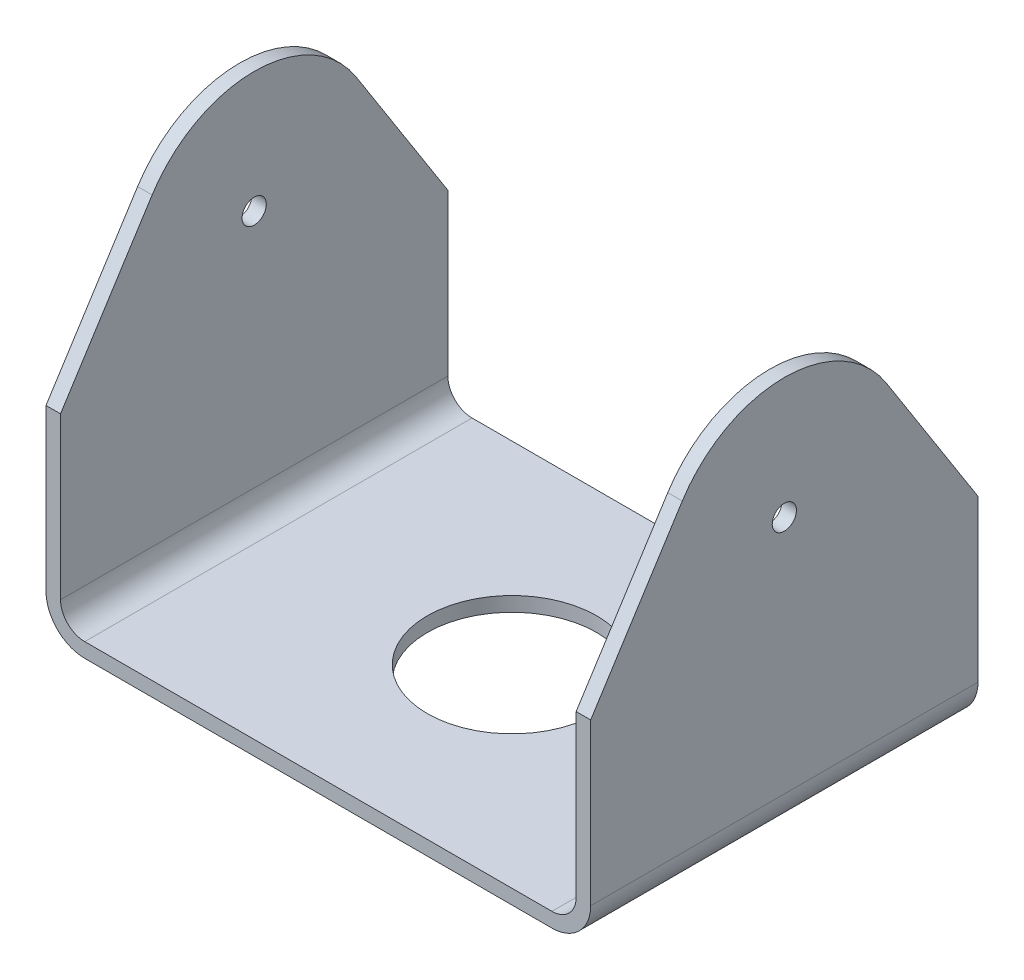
ISO-10303-21;
HEADER;
FILE_DESCRIPTION(('STEP AP214'),'2;1');
FILE_NAME('part.step','',(''),(''),'','','');
FILE_SCHEMA(('AUTOMOTIVE_DESIGN { 1 0 10303 214 1 1 1 1 }'));
ENDSEC;
DATA;
#1=APPLICATION_CONTEXT('core data for automotive mechanical design processes');
#2=APPLICATION_PROTOCOL_DEFINITION('international standard','automotive_design',2000,#1);
#3=PRODUCT_CONTEXT('',#1,'mechanical');
#4=PRODUCT('Part','Part','',(#3));
#5=PRODUCT_RELATED_PRODUCT_CATEGORY('part','',(#4));
#6=PRODUCT_DEFINITION_FORMATION('','',#4);
#7=PRODUCT_DEFINITION_CONTEXT('part definition',#1,'design');
#8=PRODUCT_DEFINITION('design','',#6,#7);
#9=PRODUCT_DEFINITION_SHAPE('','',#8);
#10=(LENGTH_UNIT() NAMED_UNIT(*) SI_UNIT(.MILLI.,.METRE.));
#11=(NAMED_UNIT(*) PLANE_ANGLE_UNIT() SI_UNIT($,.RADIAN.));
#12=(NAMED_UNIT(*) SI_UNIT($,.STERADIAN.) SOLID_ANGLE_UNIT());
#13=UNCERTAINTY_MEASURE_WITH_UNIT(LENGTH_MEASURE(1.E-05),#10,'distance_accuracy_value','');
#14=(GEOMETRIC_REPRESENTATION_CONTEXT(3) GLOBAL_UNCERTAINTY_ASSIGNED_CONTEXT((#13)) GLOBAL_UNIT_ASSIGNED_CONTEXT((#10,
#11,#12)) REPRESENTATION_CONTEXT('',''));
#15=CARTESIAN_POINT('',(0.,0.,0.));
#16=DIRECTION('',(0.,0.,1.));
#17=DIRECTION('',(1.,0.,0.));
#18=AXIS2_PLACEMENT_3D('',#15,#16,#17);
#19=CARTESIAN_POINT('',(56.25,8.,40.));
#20=DIRECTION('',(-1.,0.,0.));
#21=DIRECTION('',(0.,-1.,0.));
#22=AXIS2_PLACEMENT_3D('',#19,#20,#21);
#23=PLANE('',#22);
#24=CARTESIAN_POINT('',(56.25,57.5,0.));
#25=DIRECTION('',(1.,0.,0.));
#26=DIRECTION('',(0.,1.,0.));
#27=AXIS2_PLACEMENT_3D('',#24,#25,#26);
#28=CIRCLE('',#27,2.5);
#29=CARTESIAN_POINT('',(56.25,60.,0.));
#30=VERTEX_POINT('',#29);
#31=EDGE_CURVE('E329',#30,#30,#28,.T.);
#32=ORIENTED_EDGE('',*,*,#31,.F.);
#33=EDGE_LOOP('',(#32));
#34=FACE_BOUND('',#33,.T.);
#35=DIRECTION('',(0.,0.843391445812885,-0.537299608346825));
#36=VECTOR('',#35,1.);
#37=CARTESIAN_POINT('',(56.25,70.9324902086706,21.0847861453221));
#38=LINE('',#37,#36);
#39=CARTESIAN_POINT('',(56.25,41.2415518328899,40.));
#40=VERTEX_POINT('',#39);
#41=CARTESIAN_POINT('',(56.25,70.9324902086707,21.0847861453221));
#42=VERTEX_POINT('',#41);
#43=EDGE_CURVE('E176',#40,#42,#38,.T.);
#44=ORIENTED_EDGE('',*,*,#43,.F.);
#45=DIRECTION('',(0.,1.,0.));
#46=VECTOR('',#45,1.);
#47=CARTESIAN_POINT('',(56.25,8.,40.));
#48=LINE('',#47,#46);
#49=CARTESIAN_POINT('',(56.25,8.,40.));
#50=VERTEX_POINT('',#49);
#51=EDGE_CURVE('E219',#50,#40,#48,.T.);
#52=ORIENTED_EDGE('',*,*,#51,.F.);
#53=DIRECTION('',(0.,0.,-1.));
#54=VECTOR('',#53,1.);
#55=CARTESIAN_POINT('',(56.25,8.,40.));
#56=LINE('',#55,#54);
#57=CARTESIAN_POINT('',(56.25,8.,-40.));
#58=VERTEX_POINT('',#57);
#59=EDGE_CURVE('E243',#50,#58,#56,.T.);
#60=ORIENTED_EDGE('',*,*,#59,.T.);
#61=DIRECTION('',(0.,1.,0.));
#62=VECTOR('',#61,1.);
#63=CARTESIAN_POINT('',(56.25,8.,-40.));
#64=LINE('',#63,#62);
#65=CARTESIAN_POINT('',(56.25,41.2415518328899,-40.));
#66=VERTEX_POINT('',#65);
#67=EDGE_CURVE('E151',#58,#66,#64,.T.);
#68=ORIENTED_EDGE('',*,*,#67,.T.);
#69=DIRECTION('',(0.,-0.843391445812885,-0.537299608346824));
#70=VECTOR('',#69,1.);
#71=CARTESIAN_POINT('',(56.25,70.9324902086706,-21.0847861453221));
#72=LINE('',#71,#70);
#73=CARTESIAN_POINT('',(56.25,70.9324902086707,-21.0847861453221));
#74=VERTEX_POINT('',#73);
#75=EDGE_CURVE('E166',#74,#66,#72,.T.);
#76=ORIENTED_EDGE('',*,*,#75,.F.);
#77=CARTESIAN_POINT('',(56.25,57.5,0.));
#78=DIRECTION('',(-1.,0.,0.));
#79=DIRECTION('',(0.,1.,0.));
#80=AXIS2_PLACEMENT_3D('',#77,#78,#79);
#81=CIRCLE('',#80,25.);
#82=EDGE_CURVE('E45',#42,#74,#81,.T.);
#83=ORIENTED_EDGE('',*,*,#82,.F.);
#84=EDGE_LOOP('',(#44,#52,#60,#68,#76,#83));
#85=FACE_BOUND('',#84,.T.);
#86=ADVANCED_FACE('F31',(#34,#85),#23,.F.);
#87=CARTESIAN_POINT('',(53.25,8.,40.));
#88=DIRECTION('',(-1.,0.,0.));
#89=DIRECTION('',(0.,-1.,0.));
#90=AXIS2_PLACEMENT_3D('',#87,#88,#89);
#91=PLANE('',#90);
#92=CARTESIAN_POINT('',(53.25,57.5,0.));
#93=DIRECTION('',(-1.,0.,0.));
#94=DIRECTION('',(0.,-1.,0.));
#95=AXIS2_PLACEMENT_3D('',#92,#93,#94);
#96=CIRCLE('',#95,2.5);
#97=CARTESIAN_POINT('',(53.25,55.,0.));
#98=VERTEX_POINT('',#97);
#99=EDGE_CURVE('E410',#98,#98,#96,.T.);
#100=ORIENTED_EDGE('',*,*,#99,.F.);
#101=EDGE_LOOP('',(#100));
#102=FACE_BOUND('',#101,.T.);
#103=DIRECTION('',(0.,1.,0.));
#104=VECTOR('',#103,1.);
#105=CARTESIAN_POINT('',(53.25,8.,40.));
#106=LINE('',#105,#104);
#107=CARTESIAN_POINT('',(53.25,8.,40.));
#108=VERTEX_POINT('',#107);
#109=CARTESIAN_POINT('',(53.25,41.2415518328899,40.));
#110=VERTEX_POINT('',#109);
#111=EDGE_CURVE('E222',#108,#110,#106,.T.);
#112=ORIENTED_EDGE('',*,*,#111,.T.);
#113=DIRECTION('',(0.,0.843391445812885,-0.537299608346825));
#114=VECTOR('',#113,1.);
#115=CARTESIAN_POINT('',(53.25,17.5965324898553,55.0635386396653));
#116=LINE('',#115,#114);
#117=CARTESIAN_POINT('',(53.25,70.9324902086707,21.0847861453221));
#118=VERTEX_POINT('',#117);
#119=EDGE_CURVE('E191',#110,#118,#116,.T.);
#120=ORIENTED_EDGE('',*,*,#119,.T.);
#121=CARTESIAN_POINT('',(53.25,57.5,0.));
#122=DIRECTION('',(-1.,0.,0.));
#123=DIRECTION('',(0.,-1.,0.));
#124=AXIS2_PLACEMENT_3D('',#121,#122,#123);
#125=CIRCLE('',#124,25.);
#126=CARTESIAN_POINT('',(53.25,70.9324902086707,-21.0847861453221));
#127=VERTEX_POINT('',#126);
#128=EDGE_CURVE('E158',#118,#127,#125,.T.);
#129=ORIENTED_EDGE('',*,*,#128,.T.);
#130=DIRECTION('',(0.,-0.843391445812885,-0.537299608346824));
#131=VECTOR('',#130,1.);
#132=CARTESIAN_POINT('',(53.25,53.8488439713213,-31.9682691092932));
#133=LINE('',#132,#131);
#134=CARTESIAN_POINT('',(53.25,41.2415518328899,-40.));
#135=VERTEX_POINT('',#134);
#136=EDGE_CURVE('E154',#127,#135,#133,.T.);
#137=ORIENTED_EDGE('',*,*,#136,.T.);
#138=DIRECTION('',(0.,1.,0.));
#139=VECTOR('',#138,1.);
#140=CARTESIAN_POINT('',(53.25,8.,-40.));
#141=LINE('',#140,#139);
#142=CARTESIAN_POINT('',(53.25,8.,-40.));
#143=VERTEX_POINT('',#142);
#144=EDGE_CURVE('E140',#143,#135,#141,.T.);
#145=ORIENTED_EDGE('',*,*,#144,.F.);
#146=DIRECTION('',(0.,0.,-1.));
#147=VECTOR('',#146,1.);
#148=CARTESIAN_POINT('',(53.25,8.,40.));
#149=LINE('',#148,#147);
#150=EDGE_CURVE('E262',#108,#143,#149,.T.);
#151=ORIENTED_EDGE('',*,*,#150,.F.);
#152=EDGE_LOOP('',(#112,#120,#129,#137,#145,#151));
#153=FACE_BOUND('',#152,.T.);
#154=ADVANCED_FACE('F156',(#102,#153),#91,.T.);
#155=CARTESIAN_POINT('',(-53.25,82.5,40.));
#156=DIRECTION('',(1.,0.,0.));
#157=DIRECTION('',(0.,1.,0.));
#158=AXIS2_PLACEMENT_3D('',#155,#156,#157);
#159=PLANE('',#158);
#160=CARTESIAN_POINT('',(-53.25,57.5,0.));
#161=DIRECTION('',(1.,0.,0.));
#162=DIRECTION('',(0.,1.,0.));
#163=AXIS2_PLACEMENT_3D('',#160,#161,#162);
#164=CIRCLE('',#163,2.5);
#165=CARTESIAN_POINT('',(-53.25,60.,0.));
#166=VERTEX_POINT('',#165);
#167=EDGE_CURVE('E405',#166,#166,#164,.T.);
#168=ORIENTED_EDGE('',*,*,#167,.F.);
#169=EDGE_LOOP('',(#168));
#170=FACE_BOUND('',#169,.T.);
#171=CARTESIAN_POINT('',(-53.25,57.5,0.));
#172=DIRECTION('',(1.,0.,0.));
#173=DIRECTION('',(0.,1.,0.));
#174=AXIS2_PLACEMENT_3D('',#171,#172,#173);
#175=CIRCLE('',#174,25.);
#176=CARTESIAN_POINT('',(-53.25,70.9324902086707,-21.0847861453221));
#177=VERTEX_POINT('',#176);
#178=CARTESIAN_POINT('',(-53.25,70.9324902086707,21.0847861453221));
#179=VERTEX_POINT('',#178);
#180=EDGE_CURVE('E193',#177,#179,#175,.T.);
#181=ORIENTED_EDGE('',*,*,#180,.T.);
#182=DIRECTION('',(0.,-0.843391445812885,0.537299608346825));
#183=VECTOR('',#182,1.);
#184=CARTESIAN_POINT('',(-53.25,70.5890627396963,21.30357357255));
#185=LINE('',#184,#183);
#186=CARTESIAN_POINT('',(-53.25,41.2415518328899,40.));
#187=VERTEX_POINT('',#186);
#188=EDGE_CURVE('E189',#179,#187,#185,.T.);
#189=ORIENTED_EDGE('',*,*,#188,.T.);
#190=DIRECTION('',(0.,-1.,0.));
#191=VECTOR('',#190,1.);
#192=CARTESIAN_POINT('',(-53.25,82.5,40.));
#193=LINE('',#192,#191);
#194=CARTESIAN_POINT('',(-53.25,8.,40.));
#195=VERTEX_POINT('',#194);
#196=EDGE_CURVE('E233',#187,#195,#193,.T.);
#197=ORIENTED_EDGE('',*,*,#196,.T.);
#198=DIRECTION('',(0.,0.,-1.));
#199=VECTOR('',#198,1.);
#200=CARTESIAN_POINT('',(-53.25,8.,40.));
#201=LINE('',#200,#199);
#202=CARTESIAN_POINT('',(-53.25,8.,-40.));
#203=VERTEX_POINT('',#202);
#204=EDGE_CURVE('E255',#195,#203,#201,.T.);
#205=ORIENTED_EDGE('',*,*,#204,.T.);
#206=DIRECTION('',(0.,-1.,0.));
#207=VECTOR('',#206,1.);
#208=CARTESIAN_POINT('',(-53.25,82.5,-40.));
#209=LINE('',#208,#207);
#210=CARTESIAN_POINT('',(-53.25,41.2415518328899,-40.));
#211=VERTEX_POINT('',#210);
#212=EDGE_CURVE('E209',#211,#203,#209,.T.);
#213=ORIENTED_EDGE('',*,*,#212,.F.);
#214=DIRECTION('',(0.,0.843391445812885,0.537299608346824));
#215=VECTOR('',#214,1.);
#216=CARTESIAN_POINT('',(-53.25,106.841374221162,1.79169595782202));
#217=LINE('',#216,#215);
#218=EDGE_CURVE('E162',#211,#177,#217,.T.);
#219=ORIENTED_EDGE('',*,*,#218,.T.);
#220=EDGE_LOOP('',(#181,#189,#197,#205,#213,#219));
#221=FACE_BOUND('',#220,.T.);
#222=ADVANCED_FACE('F293',(#170,#221),#159,.T.);
#223=CARTESIAN_POINT('',(-56.25,82.5,40.));
#224=DIRECTION('',(1.,0.,0.));
#225=DIRECTION('',(0.,1.,0.));
#226=AXIS2_PLACEMENT_3D('',#223,#224,#225);
#227=PLANE('',#226);
#228=CARTESIAN_POINT('',(-56.25,57.5,0.));
#229=DIRECTION('',(1.,0.,0.));
#230=DIRECTION('',(0.,1.,0.));
#231=AXIS2_PLACEMENT_3D('',#228,#229,#230);
#232=CIRCLE('',#231,2.5);
#233=CARTESIAN_POINT('',(-56.25,60.,0.));
#234=VERTEX_POINT('',#233);
#235=EDGE_CURVE('E408',#234,#234,#232,.T.);
#236=ORIENTED_EDGE('',*,*,#235,.T.);
#237=EDGE_LOOP('',(#236));
#238=FACE_BOUND('',#237,.T.);
#239=DIRECTION('',(0.,-0.843391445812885,0.537299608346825));
#240=VECTOR('',#239,1.);
#241=CARTESIAN_POINT('',(-56.25,70.5890627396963,21.30357357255));
#242=LINE('',#241,#240);
#243=CARTESIAN_POINT('',(-56.25,70.9324902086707,21.0847861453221));
#244=VERTEX_POINT('',#243);
#245=CARTESIAN_POINT('',(-56.25,41.2415518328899,40.));
#246=VERTEX_POINT('',#245);
#247=EDGE_CURVE('E161',#244,#246,#242,.T.);
#248=ORIENTED_EDGE('',*,*,#247,.F.);
#249=CARTESIAN_POINT('',(-56.25,57.5,0.));
#250=DIRECTION('',(1.,0.,0.));
#251=DIRECTION('',(0.,1.,0.));
#252=AXIS2_PLACEMENT_3D('',#249,#250,#251);
#253=CIRCLE('',#252,25.);
#254=CARTESIAN_POINT('',(-56.25,70.9324902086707,-21.0847861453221));
#255=VERTEX_POINT('',#254);
#256=EDGE_CURVE('E11',#255,#244,#253,.T.);
#257=ORIENTED_EDGE('',*,*,#256,.F.);
#258=DIRECTION('',(0.,0.843391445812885,0.537299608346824));
#259=VECTOR('',#258,1.);
#260=CARTESIAN_POINT('',(-56.25,106.841374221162,1.79169595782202));
#261=LINE('',#260,#259);
#262=CARTESIAN_POINT('',(-56.25,41.2415518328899,-40.));
#263=VERTEX_POINT('',#262);
#264=EDGE_CURVE('E183',#263,#255,#261,.T.);
#265=ORIENTED_EDGE('',*,*,#264,.F.);
#266=DIRECTION('',(0.,-1.,0.));
#267=VECTOR('',#266,1.);
#268=CARTESIAN_POINT('',(-56.25,82.5,-40.));
#269=LINE('',#268,#267);
#270=CARTESIAN_POINT('',(-56.25,8.,-40.));
#271=VERTEX_POINT('',#270);
#272=EDGE_CURVE('E211',#263,#271,#269,.T.);
#273=ORIENTED_EDGE('',*,*,#272,.T.);
#274=DIRECTION('',(0.,0.,-1.));
#275=VECTOR('',#274,1.);
#276=CARTESIAN_POINT('',(-56.25,8.,40.));
#277=LINE('',#276,#275);
#278=CARTESIAN_POINT('',(-56.25,8.,40.));
#279=VERTEX_POINT('',#278);
#280=EDGE_CURVE('E252',#279,#271,#277,.T.);
#281=ORIENTED_EDGE('',*,*,#280,.F.);
#282=DIRECTION('',(0.,-1.,0.));
#283=VECTOR('',#282,1.);
#284=CARTESIAN_POINT('',(-56.25,82.5,40.));
#285=LINE('',#284,#283);
#286=EDGE_CURVE('E235',#246,#279,#285,.T.);
#287=ORIENTED_EDGE('',*,*,#286,.F.);
#288=EDGE_LOOP('',(#248,#257,#265,#273,#281,#287));
#289=FACE_BOUND('',#288,.T.);
#290=ADVANCED_FACE('F277',(#238,#289),#227,.F.);
#291=CARTESIAN_POINT('',(48.25,8.,40.));
#292=DIRECTION('',(0.,0.,1.));
#293=DIRECTION('',(1.,0.,0.));
#294=AXIS2_PLACEMENT_3D('',#291,#292,#293);
#295=PLANE('',#294);
#296=ORIENTED_EDGE('',*,*,#51,.T.);
#297=DIRECTION('',(-1.,0.,0.));
#298=VECTOR('',#297,1.);
#299=CARTESIAN_POINT('',(56.25,41.2415518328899,40.));
#300=LINE('',#299,#298);
#301=EDGE_CURVE('E180',#40,#110,#300,.T.);
#302=ORIENTED_EDGE('',*,*,#301,.T.);
#303=ORIENTED_EDGE('',*,*,#111,.F.);
#304=CARTESIAN_POINT('',(48.25,8.,40.));
#305=DIRECTION('',(0.,0.,1.));
#306=DIRECTION('',(1.,0.,0.));
#307=AXIS2_PLACEMENT_3D('',#304,#305,#306);
#308=CIRCLE('',#307,5.);
#309=CARTESIAN_POINT('',(48.25,3.,40.));
#310=VERTEX_POINT('',#309);
#311=EDGE_CURVE('E224',#310,#108,#308,.T.);
#312=ORIENTED_EDGE('',*,*,#311,.F.);
#313=DIRECTION('',(1.,0.,0.));
#314=VECTOR('',#313,1.);
#315=CARTESIAN_POINT('',(-48.25,3.,40.));
#316=LINE('',#315,#314);
#317=CARTESIAN_POINT('',(-48.25,3.,40.));
#318=VERTEX_POINT('',#317);
#319=EDGE_CURVE('E227',#318,#310,#316,.T.);
#320=ORIENTED_EDGE('',*,*,#319,.F.);
#321=CARTESIAN_POINT('',(-48.25,8.,40.));
#322=DIRECTION('',(0.,0.,1.));
#323=DIRECTION('',(1.,0.,0.));
#324=AXIS2_PLACEMENT_3D('',#321,#322,#323);
#325=CIRCLE('',#324,5.00000000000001);
#326=EDGE_CURVE('E230',#195,#318,#325,.T.);
#327=ORIENTED_EDGE('',*,*,#326,.F.);
#328=ORIENTED_EDGE('',*,*,#196,.F.);
#329=DIRECTION('',(-1.,0.,0.));
#330=VECTOR('',#329,1.);
#331=CARTESIAN_POINT('',(48.25,41.2415518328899,40.));
#332=LINE('',#331,#330);
#333=EDGE_CURVE('E38',#187,#246,#332,.T.);
#334=ORIENTED_EDGE('',*,*,#333,.T.);
#335=ORIENTED_EDGE('',*,*,#286,.T.);
#336=CARTESIAN_POINT('',(-48.25,8.,40.));
#337=DIRECTION('',(0.,0.,1.));
#338=DIRECTION('',(1.,0.,0.));
#339=AXIS2_PLACEMENT_3D('',#336,#337,#338);
#340=CIRCLE('',#339,8.00000000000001);
#341=CARTESIAN_POINT('',(-48.25,0.,40.));
#342=VERTEX_POINT('',#341);
#343=EDGE_CURVE('E237',#279,#342,#340,.T.);
#344=ORIENTED_EDGE('',*,*,#343,.T.);
#345=DIRECTION('',(1.,0.,0.));
#346=VECTOR('',#345,1.);
#347=CARTESIAN_POINT('',(-48.25,0.,40.));
#348=LINE('',#347,#346);
#349=CARTESIAN_POINT('',(48.25,0.,40.));
#350=VERTEX_POINT('',#349);
#351=EDGE_CURVE('E239',#342,#350,#348,.T.);
#352=ORIENTED_EDGE('',*,*,#351,.T.);
#353=CARTESIAN_POINT('',(48.25,8.,40.));
#354=DIRECTION('',(0.,0.,1.));
#355=DIRECTION('',(1.,0.,0.));
#356=AXIS2_PLACEMENT_3D('',#353,#354,#355);
#357=CIRCLE('',#356,8.);
#358=EDGE_CURVE('E241',#350,#50,#357,.T.);
#359=ORIENTED_EDGE('',*,*,#358,.T.);
#360=EDGE_LOOP('',(#296,#302,#303,#312,#320,#327,#328,#334,#335,#344,#352,#359));
#361=FACE_BOUND('',#360,.T.);
#362=ADVANCED_FACE('F270',(#361),#295,.T.);
#363=CARTESIAN_POINT('',(48.25,8.,-40.));
#364=DIRECTION('',(0.,0.,1.));
#365=DIRECTION('',(1.,0.,0.));
#366=AXIS2_PLACEMENT_3D('',#363,#364,#365);
#367=PLANE('',#366);
#368=DIRECTION('',(-1.,0.,0.));
#369=VECTOR('',#368,1.);
#370=CARTESIAN_POINT('',(56.25,41.2415518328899,-40.));
#371=LINE('',#370,#369);
#372=EDGE_CURVE('E145',#66,#135,#371,.T.);
#373=ORIENTED_EDGE('',*,*,#372,.F.);
#374=ORIENTED_EDGE('',*,*,#67,.F.);
#375=CARTESIAN_POINT('',(48.25,8.,-40.));
#376=DIRECTION('',(0.,0.,1.));
#377=DIRECTION('',(1.,0.,0.));
#378=AXIS2_PLACEMENT_3D('',#375,#376,#377);
#379=CIRCLE('',#378,8.);
#380=CARTESIAN_POINT('',(48.25,0.,-40.));
#381=VERTEX_POINT('',#380);
#382=EDGE_CURVE('E217',#381,#58,#379,.T.);
#383=ORIENTED_EDGE('',*,*,#382,.F.);
#384=DIRECTION('',(1.,0.,0.));
#385=VECTOR('',#384,1.);
#386=CARTESIAN_POINT('',(-48.25,0.,-40.));
#387=LINE('',#386,#385);
#388=CARTESIAN_POINT('',(-48.25,0.,-40.));
#389=VERTEX_POINT('',#388);
#390=EDGE_CURVE('E215',#389,#381,#387,.T.);
#391=ORIENTED_EDGE('',*,*,#390,.F.);
#392=CARTESIAN_POINT('',(-48.25,8.,-40.));
#393=DIRECTION('',(0.,0.,1.));
#394=DIRECTION('',(1.,0.,0.));
#395=AXIS2_PLACEMENT_3D('',#392,#393,#394);
#396=CIRCLE('',#395,8.00000000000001);
#397=EDGE_CURVE('E213',#271,#389,#396,.T.);
#398=ORIENTED_EDGE('',*,*,#397,.F.);
#399=ORIENTED_EDGE('',*,*,#272,.F.);
#400=DIRECTION('',(-1.,0.,0.));
#401=VECTOR('',#400,1.);
#402=CARTESIAN_POINT('',(48.25,41.2415518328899,-40.));
#403=LINE('',#402,#401);
#404=EDGE_CURVE('E264',#211,#263,#403,.T.);
#405=ORIENTED_EDGE('',*,*,#404,.F.);
#406=ORIENTED_EDGE('',*,*,#212,.T.);
#407=CARTESIAN_POINT('',(-48.25,8.,-40.));
#408=DIRECTION('',(0.,0.,1.));
#409=DIRECTION('',(1.,0.,0.));
#410=AXIS2_PLACEMENT_3D('',#407,#408,#409);
#411=CIRCLE('',#410,5.00000000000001);
#412=CARTESIAN_POINT('',(-48.25,3.,-40.));
#413=VERTEX_POINT('',#412);
#414=EDGE_CURVE('E206',#203,#413,#411,.T.);
#415=ORIENTED_EDGE('',*,*,#414,.T.);
#416=DIRECTION('',(1.,0.,0.));
#417=VECTOR('',#416,1.);
#418=CARTESIAN_POINT('',(-48.25,3.,-40.));
#419=LINE('',#418,#417);
#420=CARTESIAN_POINT('',(48.25,3.,-40.));
#421=VERTEX_POINT('',#420);
#422=EDGE_CURVE('E204',#413,#421,#419,.T.);
#423=ORIENTED_EDGE('',*,*,#422,.T.);
#424=CARTESIAN_POINT('',(48.25,8.,-40.));
#425=DIRECTION('',(0.,0.,1.));
#426=DIRECTION('',(1.,0.,0.));
#427=AXIS2_PLACEMENT_3D('',#424,#425,#426);
#428=CIRCLE('',#427,5.);
#429=EDGE_CURVE('E149',#421,#143,#428,.T.);
#430=ORIENTED_EDGE('',*,*,#429,.T.);
#431=ORIENTED_EDGE('',*,*,#144,.T.);
#432=EDGE_LOOP('',(#373,#374,#383,#391,#398,#399,#405,#406,#415,#423,#430,#431));
#433=FACE_BOUND('',#432,.T.);
#434=ADVANCED_FACE('F142',(#433),#367,.F.);
#435=CARTESIAN_POINT('',(48.25,8.,40.));
#436=DIRECTION('',(0.,0.,-1.));
#437=DIRECTION('',(-1.,0.,0.));
#438=AXIS2_PLACEMENT_3D('',#435,#436,#437);
#439=CYLINDRICAL_SURFACE('',#438,5.);
#440=ORIENTED_EDGE('',*,*,#429,.F.);
#441=DIRECTION('',(0.,0.,-1.));
#442=VECTOR('',#441,1.);
#443=CARTESIAN_POINT('',(48.25,3.,40.));
#444=LINE('',#443,#442);
#445=EDGE_CURVE('E260',#310,#421,#444,.T.);
#446=ORIENTED_EDGE('',*,*,#445,.F.);
#447=ORIENTED_EDGE('',*,*,#311,.T.);
#448=ORIENTED_EDGE('',*,*,#150,.T.);
#449=EDGE_LOOP('',(#440,#446,#447,#448));
#450=FACE_BOUND('',#449,.T.);
#451=ADVANCED_FACE('F304',(#450),#439,.F.);
#452=CARTESIAN_POINT('',(-48.25,3.,40.));
#453=DIRECTION('',(0.,1.,0.));
#454=DIRECTION('',(0.,0.,1.));
#455=AXIS2_PLACEMENT_3D('',#452,#453,#454);
#456=PLANE('',#455);
#457=CARTESIAN_POINT('',(0.,3.,0.));
#458=DIRECTION('',(0.,1.,0.));
#459=DIRECTION('',(0.,0.,1.));
#460=AXIS2_PLACEMENT_3D('',#457,#458,#459);
#461=CIRCLE('',#460,17.5);
#462=CARTESIAN_POINT('',(0.,3.,17.5));
#463=VERTEX_POINT('',#462);
#464=EDGE_CURVE('E196',#463,#463,#461,.T.);
#465=ORIENTED_EDGE('',*,*,#464,.F.);
#466=EDGE_LOOP('',(#465));
#467=FACE_BOUND('',#466,.T.);
#468=ORIENTED_EDGE('',*,*,#422,.F.);
#469=DIRECTION('',(0.,0.,-1.));
#470=VECTOR('',#469,1.);
#471=CARTESIAN_POINT('',(-48.25,3.,40.));
#472=LINE('',#471,#470);
#473=EDGE_CURVE('E258',#318,#413,#472,.T.);
#474=ORIENTED_EDGE('',*,*,#473,.F.);
#475=ORIENTED_EDGE('',*,*,#319,.T.);
#476=ORIENTED_EDGE('',*,*,#445,.T.);
#477=EDGE_LOOP('',(#468,#474,#475,#476));
#478=FACE_BOUND('',#477,.T.);
#479=ADVANCED_FACE('F300',(#467,#478),#456,.T.);
#480=CARTESIAN_POINT('',(-48.25,8.,40.));
#481=DIRECTION('',(0.,0.,-1.));
#482=DIRECTION('',(-1.,0.,0.));
#483=AXIS2_PLACEMENT_3D('',#480,#481,#482);
#484=CYLINDRICAL_SURFACE('',#483,5.00000000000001);
#485=ORIENTED_EDGE('',*,*,#414,.F.);
#486=ORIENTED_EDGE('',*,*,#204,.F.);
#487=ORIENTED_EDGE('',*,*,#326,.T.);
#488=ORIENTED_EDGE('',*,*,#473,.T.);
#489=EDGE_LOOP('',(#485,#486,#487,#488));
#490=FACE_BOUND('',#489,.T.);
#491=ADVANCED_FACE('F297',(#490),#484,.F.);
#492=CARTESIAN_POINT('',(-48.25,8.,40.));
#493=DIRECTION('',(0.,0.,-1.));
#494=DIRECTION('',(-1.,0.,0.));
#495=AXIS2_PLACEMENT_3D('',#492,#493,#494);
#496=CYLINDRICAL_SURFACE('',#495,8.00000000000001);
#497=ORIENTED_EDGE('',*,*,#397,.T.);
#498=DIRECTION('',(0.,0.,-1.));
#499=VECTOR('',#498,1.);
#500=CARTESIAN_POINT('',(-48.25,0.,40.));
#501=LINE('',#500,#499);
#502=EDGE_CURVE('E249',#342,#389,#501,.T.);
#503=ORIENTED_EDGE('',*,*,#502,.F.);
#504=ORIENTED_EDGE('',*,*,#343,.F.);
#505=ORIENTED_EDGE('',*,*,#280,.T.);
#506=EDGE_LOOP('',(#497,#503,#504,#505));
#507=FACE_BOUND('',#506,.T.);
#508=ADVANCED_FACE('F342',(#507),#496,.T.);
#509=CARTESIAN_POINT('',(-48.25,0.,40.));
#510=DIRECTION('',(0.,1.,0.));
#511=DIRECTION('',(0.,0.,1.));
#512=AXIS2_PLACEMENT_3D('',#509,#510,#511);
#513=PLANE('',#512);
#514=CARTESIAN_POINT('',(0.,0.,0.));
#515=DIRECTION('',(0.,1.,0.));
#516=DIRECTION('',(0.,0.,1.));
#517=AXIS2_PLACEMENT_3D('',#514,#515,#516);
#518=CIRCLE('',#517,17.5);
#519=CARTESIAN_POINT('',(0.,0.,17.5));
#520=VERTEX_POINT('',#519);
#521=EDGE_CURVE('E199',#520,#520,#518,.F.);
#522=ORIENTED_EDGE('',*,*,#521,.F.);
#523=EDGE_LOOP('',(#522));
#524=FACE_BOUND('',#523,.T.);
#525=ORIENTED_EDGE('',*,*,#390,.T.);
#526=DIRECTION('',(0.,0.,-1.));
#527=VECTOR('',#526,1.);
#528=CARTESIAN_POINT('',(48.25,0.,40.));
#529=LINE('',#528,#527);
#530=EDGE_CURVE('E246',#350,#381,#529,.T.);
#531=ORIENTED_EDGE('',*,*,#530,.F.);
#532=ORIENTED_EDGE('',*,*,#351,.F.);
#533=ORIENTED_EDGE('',*,*,#502,.T.);
#534=EDGE_LOOP('',(#525,#531,#532,#533));
#535=FACE_BOUND('',#534,.T.);
#536=ADVANCED_FACE('F339',(#524,#535),#513,.F.);
#537=CARTESIAN_POINT('',(48.25,8.,40.));
#538=DIRECTION('',(0.,0.,-1.));
#539=DIRECTION('',(-1.,0.,0.));
#540=AXIS2_PLACEMENT_3D('',#537,#538,#539);
#541=CYLINDRICAL_SURFACE('',#540,8.);
#542=ORIENTED_EDGE('',*,*,#382,.T.);
#543=ORIENTED_EDGE('',*,*,#59,.F.);
#544=ORIENTED_EDGE('',*,*,#358,.F.);
#545=ORIENTED_EDGE('',*,*,#530,.T.);
#546=EDGE_LOOP('',(#542,#543,#544,#545));
#547=FACE_BOUND('',#546,.T.);
#548=ADVANCED_FACE('F335',(#547),#541,.T.);
#549=CARTESIAN_POINT('',(0.,-0.00100000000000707,0.));
#550=DIRECTION('',(0.,1.,0.));
#551=DIRECTION('',(0.,0.,1.));
#552=AXIS2_PLACEMENT_3D('',#549,#550,#551);
#553=CYLINDRICAL_SURFACE('',#552,17.5);
#554=ORIENTED_EDGE('',*,*,#464,.T.);
#555=EDGE_LOOP('',(#554));
#556=FACE_BOUND('',#555,.T.);
#557=ORIENTED_EDGE('',*,*,#521,.T.);
#558=EDGE_LOOP('',(#557));
#559=FACE_BOUND('',#558,.T.);
#560=ADVANCED_FACE('F373',(#556,#559),#553,.F.);
#561=CARTESIAN_POINT('',(56.25,70.9324902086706,21.0847861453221));
#562=DIRECTION('',(0.,0.537299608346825,0.843391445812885));
#563=DIRECTION('',(0.,-0.843391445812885,0.537299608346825));
#564=AXIS2_PLACEMENT_3D('',#561,#562,#563);
#565=PLANE('',#564);
#566=ORIENTED_EDGE('',*,*,#188,.F.);
#567=DIRECTION('',(-1.,0.,0.));
#568=VECTOR('',#567,1.);
#569=CARTESIAN_POINT('',(56.25,70.9324902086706,21.0847861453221));
#570=LINE('',#569,#568);
#571=EDGE_CURVE('E167',#179,#244,#570,.T.);
#572=ORIENTED_EDGE('',*,*,#571,.T.);
#573=ORIENTED_EDGE('',*,*,#247,.T.);
#574=ORIENTED_EDGE('',*,*,#333,.F.);
#575=EDGE_LOOP('',(#566,#572,#573,#574));
#576=FACE_BOUND('',#575,.T.);
#577=ADVANCED_FACE('F279',(#576),#565,.T.);
#578=CARTESIAN_POINT('',(56.25,70.9324902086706,-21.0847861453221));
#579=DIRECTION('',(0.,0.537299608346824,-0.843391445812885));
#580=DIRECTION('',(0.,0.843391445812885,0.537299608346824));
#581=AXIS2_PLACEMENT_3D('',#578,#579,#580);
#582=PLANE('',#581);
#583=ORIENTED_EDGE('',*,*,#218,.F.);
#584=ORIENTED_EDGE('',*,*,#404,.T.);
#585=ORIENTED_EDGE('',*,*,#264,.T.);
#586=DIRECTION('',(-1.,0.,0.));
#587=VECTOR('',#586,1.);
#588=CARTESIAN_POINT('',(56.25,70.9324902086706,-21.0847861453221));
#589=LINE('',#588,#587);
#590=EDGE_CURVE('E179',#177,#255,#589,.T.);
#591=ORIENTED_EDGE('',*,*,#590,.F.);
#592=EDGE_LOOP('',(#583,#584,#585,#591));
#593=FACE_BOUND('',#592,.T.);
#594=ADVANCED_FACE('F289',(#593),#582,.T.);
#595=CARTESIAN_POINT('',(56.25,57.5,0.));
#596=DIRECTION('',(-1.,0.,0.));
#597=DIRECTION('',(0.,-1.,0.));
#598=AXIS2_PLACEMENT_3D('',#595,#596,#597);
#599=CYLINDRICAL_SURFACE('',#598,25.);
#600=ORIENTED_EDGE('',*,*,#180,.F.);
#601=ORIENTED_EDGE('',*,*,#590,.T.);
#602=ORIENTED_EDGE('',*,*,#256,.T.);
#603=ORIENTED_EDGE('',*,*,#571,.F.);
#604=EDGE_LOOP('',(#600,#601,#602,#603));
#605=FACE_BOUND('',#604,.T.);
#606=ADVANCED_FACE('F283',(#605),#599,.T.);
#607=ORIENTED_EDGE('',*,*,#82,.T.);
#608=EDGE_CURVE('E172',#74,#127,#589,.T.);
#609=ORIENTED_EDGE('',*,*,#608,.T.);
#610=ORIENTED_EDGE('',*,*,#128,.F.);
#611=EDGE_CURVE('E170',#42,#118,#570,.T.);
#612=ORIENTED_EDGE('',*,*,#611,.F.);
#613=EDGE_LOOP('',(#607,#609,#610,#612));
#614=FACE_BOUND('',#613,.T.);
#615=ADVANCED_FACE('F312',(#614),#599,.T.);
#616=ORIENTED_EDGE('',*,*,#119,.F.);
#617=ORIENTED_EDGE('',*,*,#301,.F.);
#618=ORIENTED_EDGE('',*,*,#43,.T.);
#619=ORIENTED_EDGE('',*,*,#611,.T.);
#620=EDGE_LOOP('',(#616,#617,#618,#619));
#621=FACE_BOUND('',#620,.T.);
#622=ADVANCED_FACE('F311',(#621),#565,.T.);
#623=ORIENTED_EDGE('',*,*,#136,.F.);
#624=ORIENTED_EDGE('',*,*,#608,.F.);
#625=ORIENTED_EDGE('',*,*,#75,.T.);
#626=ORIENTED_EDGE('',*,*,#372,.T.);
#627=EDGE_LOOP('',(#623,#624,#625,#626));
#628=FACE_BOUND('',#627,.T.);
#629=ADVANCED_FACE('F165',(#628),#582,.T.);
#630=CARTESIAN_POINT('',(-56.25,57.5,0.));
#631=DIRECTION('',(1.,0.,0.));
#632=DIRECTION('',(0.,1.,0.));
#633=AXIS2_PLACEMENT_3D('',#630,#631,#632);
#634=CYLINDRICAL_SURFACE('',#633,2.5);
#635=ORIENTED_EDGE('',*,*,#167,.T.);
#636=EDGE_LOOP('',(#635));
#637=FACE_BOUND('',#636,.T.);
#638=ORIENTED_EDGE('',*,*,#235,.F.);
#639=EDGE_LOOP('',(#638));
#640=FACE_BOUND('',#639,.T.);
#641=ADVANCED_FACE('F392',(#637,#640),#634,.F.);
#642=ORIENTED_EDGE('',*,*,#99,.T.);
#643=EDGE_LOOP('',(#642));
#644=FACE_BOUND('',#643,.T.);
#645=ORIENTED_EDGE('',*,*,#31,.T.);
#646=EDGE_LOOP('',(#645));
#647=FACE_BOUND('',#646,.T.);
#648=ADVANCED_FACE('F396',(#644,#647),#634,.F.);
#649=CLOSED_SHELL('',(#86,#154,#222,#290,#362,#434,#451,#479,#491,#508,#536,#548,#560,#577,#594,
#606,#615,#622,#629,#641,#648));
#650=MANIFOLD_SOLID_BREP('B2',#649);
#651=ADVANCED_BREP_SHAPE_REPRESENTATION('',(#18,#650),#14);
#652=SHAPE_DEFINITION_REPRESENTATION(#9,#651);
ENDSEC;
END-ISO-10303-21;
